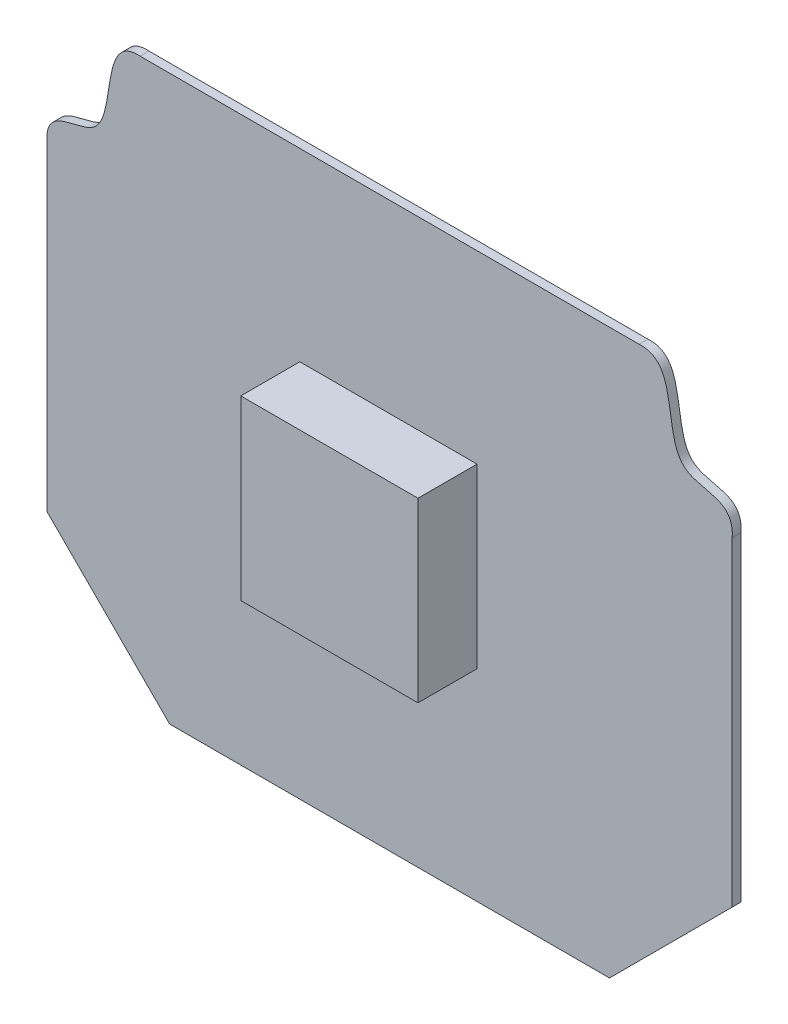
from build123d import *

# Parameters (mm, degrees)
DODANIE_WYCI_GNI_CIE1_DEPTH      = 1.5
DODANIE_WYCI_GNI_CIE2_DEPTH      = 10
DODANIE_WYCI_GNI_CIE2_DEPTH_BACK = 11.5
SZKIC2_W                         = 30
SZKIC2_H                         = 30


with BuildPart() as part:
    # Szkic1 → Dodanie-wyci_gni_cie1 (new body)
    with BuildSketch(Plane.XY):
        with BuildLine():
            Line((-102.239752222, 144.54202104), (-17.760247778, 144.54202104))
            add(Edge.make_bspline(
                [(-2, 124.044101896), (-1.592986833, 129.772442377), (-16.023217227, 125.765984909), (-10.76975246, 144.982690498), (-17.760247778, 144.54202104)],
                knots=[0, 0, 0, 0, 0.400933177, 1, 1, 1, 1], degree=3))
            Line((-2, 124.044101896), (-2, 69.895252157))
            Line((-2, 69.895252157), (-22.770828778, 49.124423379))
            Line((-22.770828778, 49.124423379), (-97.229171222, 49.124423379))
            Line((-97.229171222, 49.124423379), (-118, 69.895252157))
            Line((-118, 69.895252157), (-118, 124.044101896))
            add(Edge.make_bspline(
                [(-118, 124.044101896), (-118.407013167, 129.772442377), (-103.976782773, 125.765984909), (-109.23024754, 144.982690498), (-102.239752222, 144.54202104)],
                knots=[0, 0, 0, 0, 0.400933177, 1, 1, 1, 1], degree=3))
        make_face()
    extrude(amount=DODANIE_WYCI_GNI_CIE1_DEPTH)

    # Szkic2 → Dodanie-wyci_gni_cie2 (add, two sides: drawn at the far end of the back side and taken through both)
    with BuildSketch(Plane.XY.offset(1.5).offset(-DODANIE_WYCI_GNI_CIE2_DEPTH_BACK)):
        with Locations((-60.192549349, 98.253962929)):
            Rectangle(SZKIC2_W, SZKIC2_H)
    extrude(amount=DODANIE_WYCI_GNI_CIE2_DEPTH + DODANIE_WYCI_GNI_CIE2_DEPTH_BACK)


solid = part.part
